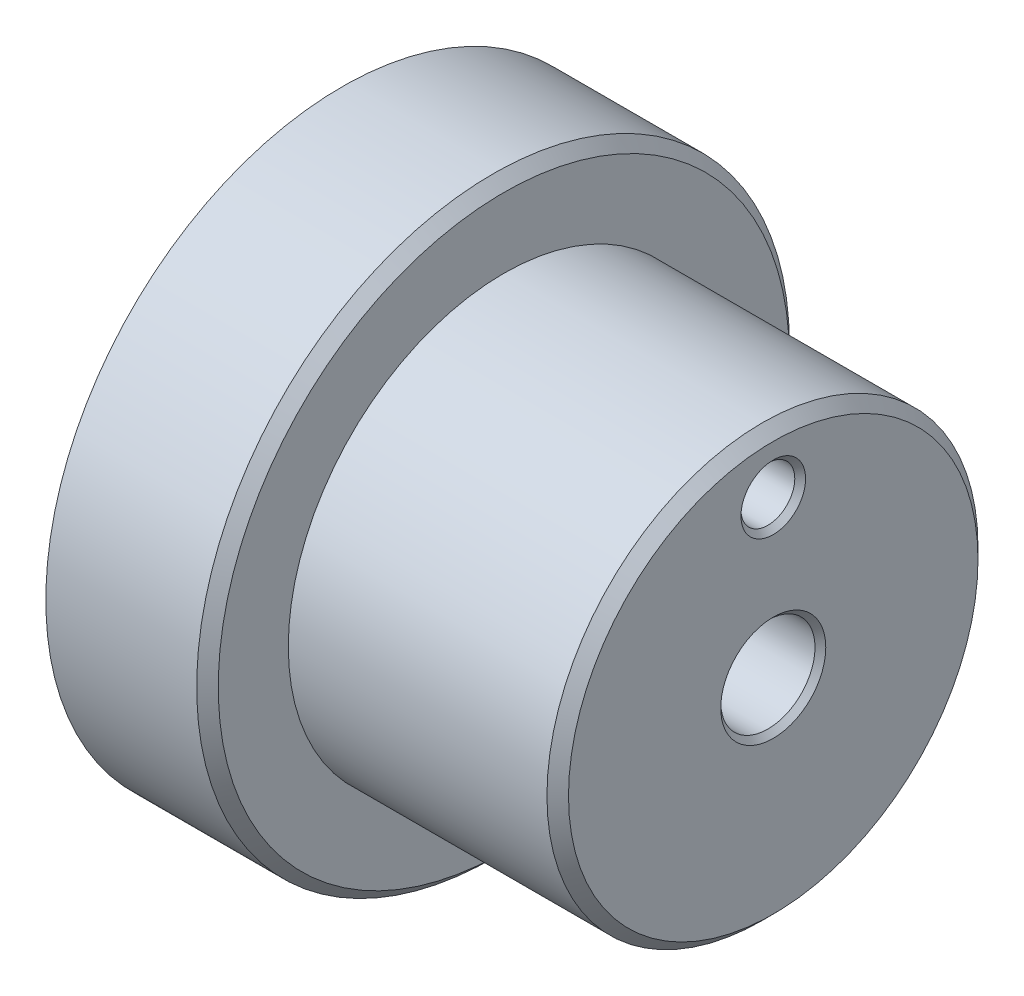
from build123d import *

# Parameters (mm, degrees)
SFAZOWANIE1_SIZE           = 2
SFAZOWANIE2_SIZE           = 1
ZAOKR_GLENIE1_R            = 1
OTW_R_GWINTOWANY_M201_D    = 17.5
SFAZOWANIE3_SIZE           = 1
WYTNIJ_WYCI_GNI_CIE1_START = -32
WYTNIJ_WYCI_GNI_CIE1_DEPTH = 60.031116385
OTW_R_GWINTOWANY_M31_D     = 2.5
OTW_R_GWINTOWANY_M31_DEPTH = 8.5
OTW_R_GWINTOWANY_M31_TIP   = 0.751075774
OTW_R_10_0_10_1_D          = 10
OTW_R_10_0_10_1_DEPTH      = 20
OTW_R_10_0_10_1_TIP        = 3.004303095
SFAZOWANIE4_SIZE           = 1


with BuildPart() as part:
    # Szkic1 → Obr_t1 (revolve)
    with BuildSketch(Plane.XY, mode=Mode.PRIVATE) as obr_t1_sk:
        Polygon((-47.29338379, 55), (-47.29338379, 45), (-37.29338379, 45), (-37.29338379, 0), (32.70661621, 0), (32.70661621, 40), (-17.29338379, 40), (-17.29338379, 55), align=None)
    revolve(obr_t1_sk.sketch.rotate(Axis((0, 0, 0), (-1, 0, 0)), 90), axis=Axis((0, 0, 0), (-1, 0, 0)))

    # Sfazowanie1
    sfazowanie1_edges = [part.edges().sort_by_distance(p)[0] for p in [
        (-17.29338379, 0, 55),
        (32.70661621, 0, 40),
    ]]
    chamfer(sfazowanie1_edges, length=SFAZOWANIE1_SIZE)

    # Sfazowanie2
    sfazowanie2_edges = [part.edges().sort_by_distance(p)[0] for p in [
        (-47.29338379, 0, 45),
    ]]
    chamfer(sfazowanie2_edges, length=SFAZOWANIE2_SIZE)

    # Zaokr_glenie1
    zaokr_glenie1_edges = [part.edges().sort_by_distance(p)[0] for p in [
        (-37.29338379, 0, 45),
    ]]
    fillet(zaokr_glenie1_edges, radius=ZAOKR_GLENIE1_R)

    # Otw_r gwintowany M201 (through all)
    with Locations(Plane.ZY.offset(37.29338379)):
        with Locations((0, 0)):
            Hole(OTW_R_GWINTOWANY_M201_D / 2)

    # Sfazowanie3
    sfazowanie3_edges = [part.edges().sort_by_distance(p)[0] for p in [
        (-37.29338379, 0, 8.75),
        (32.70661621, 0, 8.75),
    ]]
    chamfer(sfazowanie3_edges, length=SFAZOWANIE3_SIZE)

    # Szkic4 → Wytnij-wyci_gni_cie1 (cut, through all)
    with BuildSketch(Plane(origin=(0, 0, 0), x_dir=(1, 0, 0), z_dir=(0, 1, 0)).offset(WYTNIJ_WYCI_GNI_CIE1_START)):
        with BuildLine():
            Line((-5.29338379, 8), (18.70661621, 8))
            ThreePointArc((18.70661621, 8), (26.70661621, 0), (18.70661621, -8))
            Line((18.70661621, -8), (-5.29338379, -8))
            ThreePointArc((-5.29338379, -8), (-13.29338379, 0), (-5.29338379, 8))
        make_face()
    extrude(amount=-WYTNIJ_WYCI_GNI_CIE1_DEPTH, mode=Mode.SUBTRACT)

    # Otw_r gwintowany M31
    with Locations(Plane(origin=(-37.394485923, -32, 0), x_dir=(1, 0, 0), z_dir=(0, -1, 0))):
        with Locations((56.101102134, 0), (32.101102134, 0)):
            Hole(OTW_R_GWINTOWANY_M31_D / 2, depth=OTW_R_GWINTOWANY_M31_DEPTH)
            with Locations((0, 0, -(OTW_R_GWINTOWANY_M31_DEPTH + OTW_R_GWINTOWANY_M31_TIP / 2))):  # 118° drill point
                Cone(0, OTW_R_GWINTOWANY_M31_D / 2, OTW_R_GWINTOWANY_M31_TIP, mode=Mode.SUBTRACT)

    # Otw_r _10.0 _10_1
    with Locations(Plane(origin=(32.70661621, 29, 0), x_dir=(0, 0, 1), z_dir=(1, 0, 0))):
        with Locations((0, 0)):
            Hole(OTW_R_10_0_10_1_D / 2, depth=OTW_R_10_0_10_1_DEPTH)
            with Locations((0, 0, -(OTW_R_10_0_10_1_DEPTH + OTW_R_10_0_10_1_TIP / 2))):  # 118° drill point
                Cone(0, OTW_R_10_0_10_1_D / 2, OTW_R_10_0_10_1_TIP, mode=Mode.SUBTRACT)

    # Sfazowanie4
    sfazowanie4_edges = [part.edges().sort_by_distance(p)[0] for p in [
        (32.70661621, 29, 5),
    ]]
    chamfer(sfazowanie4_edges, length=SFAZOWANIE4_SIZE)


solid = part.part
